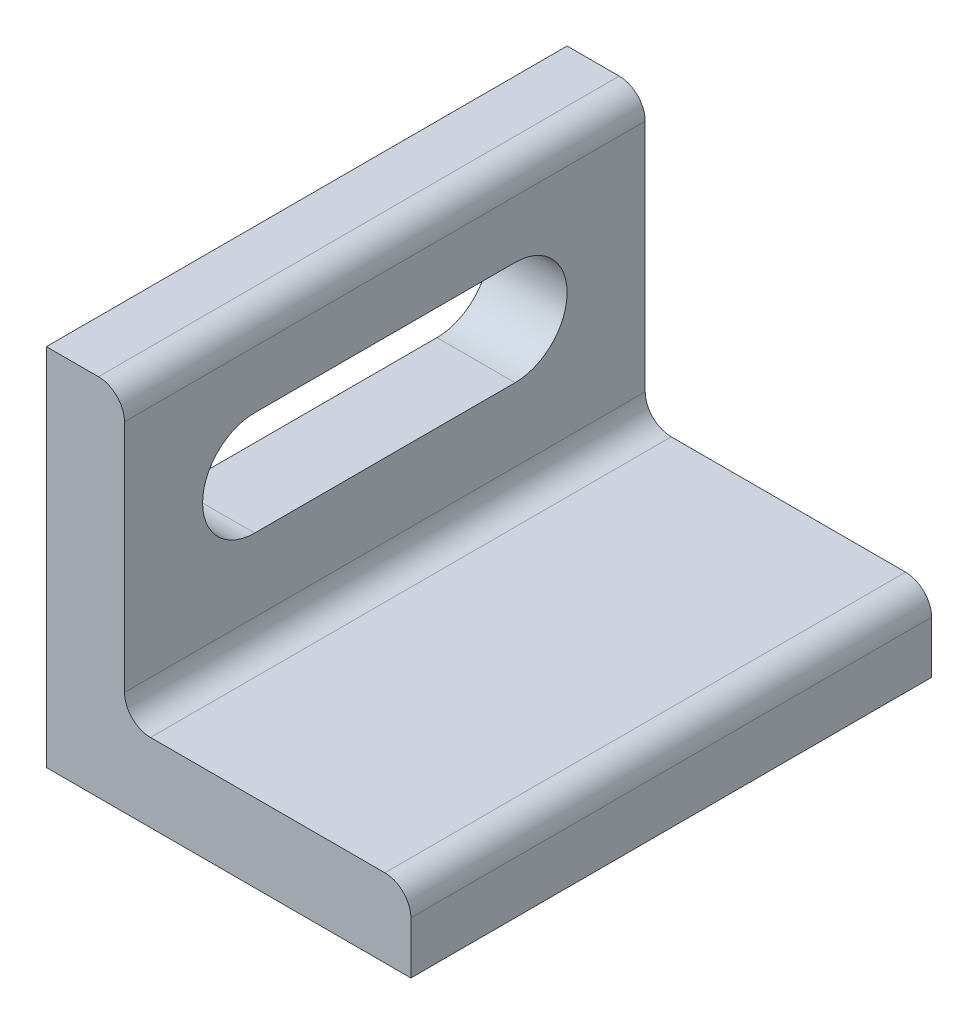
ISO-10303-21;
HEADER;
FILE_DESCRIPTION(('STEP AP214'),'2;1');
FILE_NAME('part.step','',(''),(''),'','','');
FILE_SCHEMA(('AUTOMOTIVE_DESIGN { 1 0 10303 214 1 1 1 1 }'));
ENDSEC;
DATA;
#1=APPLICATION_CONTEXT('core data for automotive mechanical design processes');
#2=APPLICATION_PROTOCOL_DEFINITION('international standard','automotive_design',2000,#1);
#3=PRODUCT_CONTEXT('',#1,'mechanical');
#4=PRODUCT('Part','Part','',(#3));
#5=PRODUCT_RELATED_PRODUCT_CATEGORY('part','',(#4));
#6=PRODUCT_DEFINITION_FORMATION('','',#4);
#7=PRODUCT_DEFINITION_CONTEXT('part definition',#1,'design');
#8=PRODUCT_DEFINITION('design','',#6,#7);
#9=PRODUCT_DEFINITION_SHAPE('','',#8);
#10=(LENGTH_UNIT() NAMED_UNIT(*) SI_UNIT(.MILLI.,.METRE.));
#11=(NAMED_UNIT(*) PLANE_ANGLE_UNIT() SI_UNIT($,.RADIAN.));
#12=(NAMED_UNIT(*) SI_UNIT($,.STERADIAN.) SOLID_ANGLE_UNIT());
#13=UNCERTAINTY_MEASURE_WITH_UNIT(LENGTH_MEASURE(1.E-05),#10,'distance_accuracy_value','');
#14=(GEOMETRIC_REPRESENTATION_CONTEXT(3) GLOBAL_UNCERTAINTY_ASSIGNED_CONTEXT((#13)) GLOBAL_UNIT_ASSIGNED_CONTEXT((#10,
#11,#12)) REPRESENTATION_CONTEXT('',''));
#15=CARTESIAN_POINT('',(0.,0.,0.));
#16=DIRECTION('',(0.,0.,1.));
#17=DIRECTION('',(1.,0.,0.));
#18=AXIS2_PLACEMENT_3D('',#15,#16,#17);
#19=CARTESIAN_POINT('',(70.,15.,100.));
#20=DIRECTION('',(1.,0.,0.));
#21=DIRECTION('',(0.,0.,-1.));
#22=AXIS2_PLACEMENT_3D('',#19,#20,#21);
#23=PLANE('',#22);
#24=DIRECTION('',(0.,-1.,0.));
#25=VECTOR('',#24,1.);
#26=CARTESIAN_POINT('',(70.,15.,0.));
#27=LINE('',#26,#25);
#28=CARTESIAN_POINT('',(70.,10.,0.));
#29=VERTEX_POINT('',#28);
#30=CARTESIAN_POINT('',(70.,0.,0.));
#31=VERTEX_POINT('',#30);
#32=EDGE_CURVE('E175',#29,#31,#27,.T.);
#33=ORIENTED_EDGE('',*,*,#32,.F.);
#34=DIRECTION('',(0.,0.,-1.));
#35=VECTOR('',#34,1.);
#36=CARTESIAN_POINT('',(70.,10.,100.));
#37=LINE('',#36,#35);
#38=CARTESIAN_POINT('',(70.,10.,100.));
#39=VERTEX_POINT('',#38);
#40=EDGE_CURVE('E63',#29,#39,#37,.F.);
#41=ORIENTED_EDGE('',*,*,#40,.T.);
#42=DIRECTION('',(0.,-1.,0.));
#43=VECTOR('',#42,1.);
#44=CARTESIAN_POINT('',(70.,15.,100.));
#45=LINE('',#44,#43);
#46=CARTESIAN_POINT('',(70.,0.,100.));
#47=VERTEX_POINT('',#46);
#48=EDGE_CURVE('E180',#39,#47,#45,.T.);
#49=ORIENTED_EDGE('',*,*,#48,.T.);
#50=DIRECTION('',(0.,0.,-1.));
#51=VECTOR('',#50,1.);
#52=CARTESIAN_POINT('',(70.,0.,100.));
#53=LINE('',#52,#51);
#54=EDGE_CURVE('E203',#47,#31,#53,.T.);
#55=ORIENTED_EDGE('',*,*,#54,.T.);
#56=EDGE_LOOP('',(#33,#41,#49,#55));
#57=FACE_BOUND('',#56,.T.);
#58=ADVANCED_FACE('F39',(#57),#23,.T.);
#59=CARTESIAN_POINT('',(15.,15.,100.));
#60=DIRECTION('',(0.,1.,0.));
#61=DIRECTION('',(0.,0.,1.));
#62=AXIS2_PLACEMENT_3D('',#59,#60,#61);
#63=PLANE('',#62);
#64=DIRECTION('',(1.,0.,0.));
#65=VECTOR('',#64,1.);
#66=CARTESIAN_POINT('',(15.,15.,0.));
#67=LINE('',#66,#65);
#68=CARTESIAN_POINT('',(20.,15.,0.));
#69=VERTEX_POINT('',#68);
#70=CARTESIAN_POINT('',(65.,15.,0.));
#71=VERTEX_POINT('',#70);
#72=EDGE_CURVE('E184',#69,#71,#67,.T.);
#73=ORIENTED_EDGE('',*,*,#72,.F.);
#74=DIRECTION('',(0.,0.,-1.));
#75=VECTOR('',#74,1.);
#76=CARTESIAN_POINT('',(20.,15.,100.));
#77=LINE('',#76,#75);
#78=CARTESIAN_POINT('',(20.,15.,100.));
#79=VERTEX_POINT('',#78);
#80=EDGE_CURVE('E257',#69,#79,#77,.F.);
#81=ORIENTED_EDGE('',*,*,#80,.T.);
#82=DIRECTION('',(1.,0.,0.));
#83=VECTOR('',#82,1.);
#84=CARTESIAN_POINT('',(15.,15.,100.));
#85=LINE('',#84,#83);
#86=CARTESIAN_POINT('',(65.,15.,100.));
#87=VERTEX_POINT('',#86);
#88=EDGE_CURVE('E199',#79,#87,#85,.T.);
#89=ORIENTED_EDGE('',*,*,#88,.T.);
#90=DIRECTION('',(0.,0.,-1.));
#91=VECTOR('',#90,1.);
#92=CARTESIAN_POINT('',(65.,15.,100.));
#93=LINE('',#92,#91);
#94=EDGE_CURVE('E253',#87,#71,#93,.T.);
#95=ORIENTED_EDGE('',*,*,#94,.T.);
#96=EDGE_LOOP('',(#73,#81,#89,#95));
#97=FACE_BOUND('',#96,.T.);
#98=ADVANCED_FACE('F285',(#97),#63,.T.);
#99=CARTESIAN_POINT('',(15.,70.,100.));
#100=DIRECTION('',(1.,0.,0.));
#101=DIRECTION('',(0.,1.,0.));
#102=AXIS2_PLACEMENT_3D('',#99,#100,#101);
#103=PLANE('',#102);
#104=CARTESIAN_POINT('',(15.,44.,75.));
#105=DIRECTION('',(1.,0.,0.));
#106=DIRECTION('',(0.,1.,0.));
#107=AXIS2_PLACEMENT_3D('',#104,#105,#106);
#108=CIRCLE('',#107,10.);
#109=CARTESIAN_POINT('',(15.,54.,75.));
#110=VERTEX_POINT('',#109);
#111=CARTESIAN_POINT('',(15.,34.,75.));
#112=VERTEX_POINT('',#111);
#113=EDGE_CURVE('E160',#110,#112,#108,.T.);
#114=ORIENTED_EDGE('',*,*,#113,.F.);
#115=DIRECTION('',(0.,0.,-1.));
#116=VECTOR('',#115,1.);
#117=CARTESIAN_POINT('',(15.,54.,75.));
#118=LINE('',#117,#116);
#119=CARTESIAN_POINT('',(15.,54.,25.));
#120=VERTEX_POINT('',#119);
#121=EDGE_CURVE('E165',#110,#120,#118,.T.);
#122=ORIENTED_EDGE('',*,*,#121,.T.);
#123=CARTESIAN_POINT('',(15.,44.,25.));
#124=DIRECTION('',(1.,0.,0.));
#125=DIRECTION('',(0.,1.,0.));
#126=AXIS2_PLACEMENT_3D('',#123,#124,#125);
#127=CIRCLE('',#126,10.);
#128=CARTESIAN_POINT('',(15.,34.,25.));
#129=VERTEX_POINT('',#128);
#130=EDGE_CURVE('E142',#129,#120,#127,.T.);
#131=ORIENTED_EDGE('',*,*,#130,.F.);
#132=DIRECTION('',(0.,0.,-1.));
#133=VECTOR('',#132,1.);
#134=CARTESIAN_POINT('',(15.,34.,75.));
#135=LINE('',#134,#133);
#136=EDGE_CURVE('E154',#112,#129,#135,.T.);
#137=ORIENTED_EDGE('',*,*,#136,.F.);
#138=EDGE_LOOP('',(#114,#122,#131,#137));
#139=FACE_BOUND('',#138,.T.);
#140=DIRECTION('',(0.,-1.,0.));
#141=VECTOR('',#140,1.);
#142=CARTESIAN_POINT('',(15.,70.,100.));
#143=LINE('',#142,#141);
#144=CARTESIAN_POINT('',(15.,65.,100.));
#145=VERTEX_POINT('',#144);
#146=CARTESIAN_POINT('',(15.,20.,100.));
#147=VERTEX_POINT('',#146);
#148=EDGE_CURVE('E195',#145,#147,#143,.T.);
#149=ORIENTED_EDGE('',*,*,#148,.T.);
#150=DIRECTION('',(0.,0.,-1.));
#151=VECTOR('',#150,1.);
#152=CARTESIAN_POINT('',(15.,20.,0.));
#153=LINE('',#152,#151);
#154=CARTESIAN_POINT('',(15.,20.,0.));
#155=VERTEX_POINT('',#154);
#156=EDGE_CURVE('E249',#147,#155,#153,.T.);
#157=ORIENTED_EDGE('',*,*,#156,.T.);
#158=DIRECTION('',(0.,-1.,0.));
#159=VECTOR('',#158,1.);
#160=CARTESIAN_POINT('',(15.,70.,0.));
#161=LINE('',#160,#159);
#162=CARTESIAN_POINT('',(15.,65.,0.));
#163=VERTEX_POINT('',#162);
#164=EDGE_CURVE('E218',#163,#155,#161,.T.);
#165=ORIENTED_EDGE('',*,*,#164,.F.);
#166=DIRECTION('',(0.,0.,-1.));
#167=VECTOR('',#166,1.);
#168=CARTESIAN_POINT('',(15.,65.,100.));
#169=LINE('',#168,#167);
#170=EDGE_CURVE('E246',#163,#145,#169,.F.);
#171=ORIENTED_EDGE('',*,*,#170,.T.);
#172=EDGE_LOOP('',(#149,#157,#165,#171));
#173=FACE_BOUND('',#172,.T.);
#174=ADVANCED_FACE('F162',(#139,#173),#103,.T.);
#175=CARTESIAN_POINT('',(0.,70.,100.));
#176=DIRECTION('',(0.,1.,0.));
#177=DIRECTION('',(0.,0.,1.));
#178=AXIS2_PLACEMENT_3D('',#175,#176,#177);
#179=PLANE('',#178);
#180=DIRECTION('',(1.,0.,0.));
#181=VECTOR('',#180,1.);
#182=CARTESIAN_POINT('',(0.,70.,100.));
#183=LINE('',#182,#181);
#184=CARTESIAN_POINT('',(0.,70.,100.));
#185=VERTEX_POINT('',#184);
#186=CARTESIAN_POINT('',(10.,70.,100.));
#187=VERTEX_POINT('',#186);
#188=EDGE_CURVE('E192',#185,#187,#183,.T.);
#189=ORIENTED_EDGE('',*,*,#188,.T.);
#190=DIRECTION('',(0.,0.,-1.));
#191=VECTOR('',#190,1.);
#192=CARTESIAN_POINT('',(10.,70.,100.));
#193=LINE('',#192,#191);
#194=CARTESIAN_POINT('',(10.,70.,0.));
#195=VERTEX_POINT('',#194);
#196=EDGE_CURVE('E273',#187,#195,#193,.T.);
#197=ORIENTED_EDGE('',*,*,#196,.T.);
#198=DIRECTION('',(1.,0.,0.));
#199=VECTOR('',#198,1.);
#200=CARTESIAN_POINT('',(0.,70.,0.));
#201=LINE('',#200,#199);
#202=CARTESIAN_POINT('',(0.,70.,0.));
#203=VERTEX_POINT('',#202);
#204=EDGE_CURVE('E214',#203,#195,#201,.T.);
#205=ORIENTED_EDGE('',*,*,#204,.F.);
#206=DIRECTION('',(0.,0.,-1.));
#207=VECTOR('',#206,1.);
#208=CARTESIAN_POINT('',(0.,70.,100.));
#209=LINE('',#208,#207);
#210=EDGE_CURVE('E225',#185,#203,#209,.T.);
#211=ORIENTED_EDGE('',*,*,#210,.F.);
#212=EDGE_LOOP('',(#189,#197,#205,#211));
#213=FACE_BOUND('',#212,.T.);
#214=ADVANCED_FACE('F296',(#213),#179,.T.);
#215=CARTESIAN_POINT('',(0.,0.,100.));
#216=DIRECTION('',(-1.,0.,0.));
#217=DIRECTION('',(0.,0.,1.));
#218=AXIS2_PLACEMENT_3D('',#215,#216,#217);
#219=PLANE('',#218);
#220=CARTESIAN_POINT('',(0.,44.,75.));
#221=DIRECTION('',(-1.,0.,0.));
#222=DIRECTION('',(0.,0.,1.));
#223=AXIS2_PLACEMENT_3D('',#220,#221,#222);
#224=CIRCLE('',#223,10.);
#225=CARTESIAN_POINT('',(0.,34.,75.));
#226=VERTEX_POINT('',#225);
#227=CARTESIAN_POINT('',(0.,54.,75.));
#228=VERTEX_POINT('',#227);
#229=EDGE_CURVE('E243',#226,#228,#224,.T.);
#230=ORIENTED_EDGE('',*,*,#229,.F.);
#231=DIRECTION('',(0.,0.,1.));
#232=VECTOR('',#231,1.);
#233=CARTESIAN_POINT('',(0.,34.,100.));
#234=LINE('',#233,#232);
#235=CARTESIAN_POINT('',(0.,34.,25.));
#236=VERTEX_POINT('',#235);
#237=EDGE_CURVE('E228',#236,#226,#234,.T.);
#238=ORIENTED_EDGE('',*,*,#237,.F.);
#239=CARTESIAN_POINT('',(0.,44.,25.));
#240=DIRECTION('',(-1.,0.,0.));
#241=DIRECTION('',(0.,0.,1.));
#242=AXIS2_PLACEMENT_3D('',#239,#240,#241);
#243=CIRCLE('',#242,10.);
#244=CARTESIAN_POINT('',(0.,54.,25.));
#245=VERTEX_POINT('',#244);
#246=EDGE_CURVE('E145',#245,#236,#243,.T.);
#247=ORIENTED_EDGE('',*,*,#246,.F.);
#248=DIRECTION('',(0.,0.,1.));
#249=VECTOR('',#248,1.);
#250=CARTESIAN_POINT('',(0.,54.,100.));
#251=LINE('',#250,#249);
#252=EDGE_CURVE('E239',#245,#228,#251,.T.);
#253=ORIENTED_EDGE('',*,*,#252,.T.);
#254=EDGE_LOOP('',(#230,#238,#247,#253));
#255=FACE_BOUND('',#254,.T.);
#256=DIRECTION('',(0.,1.,0.));
#257=VECTOR('',#256,1.);
#258=CARTESIAN_POINT('',(0.,0.,0.));
#259=LINE('',#258,#257);
#260=CARTESIAN_POINT('',(0.,0.,0.));
#261=VERTEX_POINT('',#260);
#262=EDGE_CURVE('E210',#261,#203,#259,.T.);
#263=ORIENTED_EDGE('',*,*,#262,.F.);
#264=DIRECTION('',(0.,0.,-1.));
#265=VECTOR('',#264,1.);
#266=CARTESIAN_POINT('',(0.,0.,100.));
#267=LINE('',#266,#265);
#268=CARTESIAN_POINT('',(0.,0.,100.));
#269=VERTEX_POINT('',#268);
#270=EDGE_CURVE('E229',#269,#261,#267,.T.);
#271=ORIENTED_EDGE('',*,*,#270,.F.);
#272=DIRECTION('',(0.,1.,0.));
#273=VECTOR('',#272,1.);
#274=CARTESIAN_POINT('',(0.,0.,100.));
#275=LINE('',#274,#273);
#276=EDGE_CURVE('E188',#269,#185,#275,.T.);
#277=ORIENTED_EDGE('',*,*,#276,.T.);
#278=ORIENTED_EDGE('',*,*,#210,.T.);
#279=EDGE_LOOP('',(#263,#271,#277,#278));
#280=FACE_BOUND('',#279,.T.);
#281=ADVANCED_FACE('F300',(#255,#280),#219,.T.);
#282=CARTESIAN_POINT('',(0.,0.,100.));
#283=DIRECTION('',(0.,1.,0.));
#284=DIRECTION('',(0.,0.,1.));
#285=AXIS2_PLACEMENT_3D('',#282,#283,#284);
#286=PLANE('',#285);
#287=DIRECTION('',(1.,0.,0.));
#288=VECTOR('',#287,1.);
#289=CARTESIAN_POINT('',(0.,0.,0.));
#290=LINE('',#289,#288);
#291=EDGE_CURVE('E206',#261,#31,#290,.T.);
#292=ORIENTED_EDGE('',*,*,#291,.T.);
#293=ORIENTED_EDGE('',*,*,#54,.F.);
#294=DIRECTION('',(1.,0.,0.));
#295=VECTOR('',#294,1.);
#296=CARTESIAN_POINT('',(0.,0.,100.));
#297=LINE('',#296,#295);
#298=EDGE_CURVE('E183',#269,#47,#297,.T.);
#299=ORIENTED_EDGE('',*,*,#298,.F.);
#300=ORIENTED_EDGE('',*,*,#270,.T.);
#301=EDGE_LOOP('',(#292,#293,#299,#300));
#302=FACE_BOUND('',#301,.T.);
#303=ADVANCED_FACE('F306',(#302),#286,.F.);
#304=CARTESIAN_POINT('',(0.,0.,100.));
#305=DIRECTION('',(0.,0.,1.));
#306=DIRECTION('',(1.,0.,0.));
#307=AXIS2_PLACEMENT_3D('',#304,#305,#306);
#308=PLANE('',#307);
#309=ORIENTED_EDGE('',*,*,#48,.F.);
#310=CARTESIAN_POINT('',(65.,10.,100.));
#311=DIRECTION('',(0.,0.,1.));
#312=DIRECTION('',(1.,0.,0.));
#313=AXIS2_PLACEMENT_3D('',#310,#311,#312);
#314=CIRCLE('',#313,5.);
#315=EDGE_CURVE('E270',#39,#87,#314,.T.);
#316=ORIENTED_EDGE('',*,*,#315,.T.);
#317=ORIENTED_EDGE('',*,*,#88,.F.);
#318=CARTESIAN_POINT('',(20.,20.,100.));
#319=DIRECTION('',(0.,0.,1.));
#320=DIRECTION('',(1.,0.,0.));
#321=AXIS2_PLACEMENT_3D('',#318,#319,#320);
#322=CIRCLE('',#321,5.);
#323=EDGE_CURVE('E11',#79,#147,#322,.F.);
#324=ORIENTED_EDGE('',*,*,#323,.T.);
#325=ORIENTED_EDGE('',*,*,#148,.F.);
#326=CARTESIAN_POINT('',(10.,65.,100.));
#327=DIRECTION('',(0.,0.,1.));
#328=DIRECTION('',(1.,0.,0.));
#329=AXIS2_PLACEMENT_3D('',#326,#327,#328);
#330=CIRCLE('',#329,5.);
#331=EDGE_CURVE('E55',#145,#187,#330,.T.);
#332=ORIENTED_EDGE('',*,*,#331,.T.);
#333=ORIENTED_EDGE('',*,*,#188,.F.);
#334=ORIENTED_EDGE('',*,*,#276,.F.);
#335=ORIENTED_EDGE('',*,*,#298,.T.);
#336=EDGE_LOOP('',(#309,#316,#317,#324,#325,#332,#333,#334,#335));
#337=FACE_BOUND('',#336,.T.);
#338=ADVANCED_FACE('F290',(#337),#308,.T.);
#339=CARTESIAN_POINT('',(0.,0.,0.));
#340=DIRECTION('',(0.,0.,1.));
#341=DIRECTION('',(1.,0.,0.));
#342=AXIS2_PLACEMENT_3D('',#339,#340,#341);
#343=PLANE('',#342);
#344=ORIENTED_EDGE('',*,*,#72,.T.);
#345=CARTESIAN_POINT('',(65.,10.,0.));
#346=DIRECTION('',(0.,0.,1.));
#347=DIRECTION('',(1.,0.,0.));
#348=AXIS2_PLACEMENT_3D('',#345,#346,#347);
#349=CIRCLE('',#348,5.);
#350=EDGE_CURVE('E263',#71,#29,#349,.F.);
#351=ORIENTED_EDGE('',*,*,#350,.T.);
#352=ORIENTED_EDGE('',*,*,#32,.T.);
#353=ORIENTED_EDGE('',*,*,#291,.F.);
#354=ORIENTED_EDGE('',*,*,#262,.T.);
#355=ORIENTED_EDGE('',*,*,#204,.T.);
#356=CARTESIAN_POINT('',(10.,65.,0.));
#357=DIRECTION('',(0.,0.,1.));
#358=DIRECTION('',(1.,0.,0.));
#359=AXIS2_PLACEMENT_3D('',#356,#357,#358);
#360=CIRCLE('',#359,5.);
#361=EDGE_CURVE('E260',#195,#163,#360,.F.);
#362=ORIENTED_EDGE('',*,*,#361,.T.);
#363=ORIENTED_EDGE('',*,*,#164,.T.);
#364=CARTESIAN_POINT('',(20.,20.,0.));
#365=DIRECTION('',(0.,0.,1.));
#366=DIRECTION('',(1.,0.,0.));
#367=AXIS2_PLACEMENT_3D('',#364,#365,#366);
#368=CIRCLE('',#367,5.);
#369=EDGE_CURVE('E48',#155,#69,#368,.T.);
#370=ORIENTED_EDGE('',*,*,#369,.T.);
#371=EDGE_LOOP('',(#344,#351,#352,#353,#354,#355,#362,#363,#370));
#372=FACE_BOUND('',#371,.T.);
#373=ADVANCED_FACE('F279',(#372),#343,.F.);
#374=CARTESIAN_POINT('',(-4.99999999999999,44.,75.));
#375=DIRECTION('',(1.,0.,0.));
#376=DIRECTION('',(0.,1.,0.));
#377=AXIS2_PLACEMENT_3D('',#374,#375,#376);
#378=CYLINDRICAL_SURFACE('',#377,10.);
#379=ORIENTED_EDGE('',*,*,#229,.T.);
#380=DIRECTION('',(1.,0.,0.));
#381=VECTOR('',#380,1.);
#382=CARTESIAN_POINT('',(-4.99999999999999,54.,75.));
#383=LINE('',#382,#381);
#384=EDGE_CURVE('E172',#228,#110,#383,.T.);
#385=ORIENTED_EDGE('',*,*,#384,.T.);
#386=ORIENTED_EDGE('',*,*,#113,.T.);
#387=DIRECTION('',(1.,0.,0.));
#388=VECTOR('',#387,1.);
#389=CARTESIAN_POINT('',(-4.99999999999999,34.,75.));
#390=LINE('',#389,#388);
#391=EDGE_CURVE('E150',#226,#112,#390,.T.);
#392=ORIENTED_EDGE('',*,*,#391,.F.);
#393=EDGE_LOOP('',(#379,#385,#386,#392));
#394=FACE_BOUND('',#393,.T.);
#395=ADVANCED_FACE('F333',(#394),#378,.F.);
#396=CARTESIAN_POINT('',(-4.99999999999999,54.,75.));
#397=DIRECTION('',(0.,-1.,0.));
#398=DIRECTION('',(1.,0.,0.));
#399=AXIS2_PLACEMENT_3D('',#396,#397,#398);
#400=PLANE('',#399);
#401=DIRECTION('',(1.,0.,0.));
#402=VECTOR('',#401,1.);
#403=CARTESIAN_POINT('',(-4.99999999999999,54.,25.));
#404=LINE('',#403,#402);
#405=EDGE_CURVE('E149',#245,#120,#404,.T.);
#406=ORIENTED_EDGE('',*,*,#405,.T.);
#407=ORIENTED_EDGE('',*,*,#121,.F.);
#408=ORIENTED_EDGE('',*,*,#384,.F.);
#409=ORIENTED_EDGE('',*,*,#252,.F.);
#410=EDGE_LOOP('',(#406,#407,#408,#409));
#411=FACE_BOUND('',#410,.T.);
#412=ADVANCED_FACE('F338',(#411),#400,.T.);
#413=CARTESIAN_POINT('',(-4.99999999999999,44.,25.));
#414=DIRECTION('',(1.,0.,0.));
#415=DIRECTION('',(0.,1.,0.));
#416=AXIS2_PLACEMENT_3D('',#413,#414,#415);
#417=CYLINDRICAL_SURFACE('',#416,10.);
#418=ORIENTED_EDGE('',*,*,#246,.T.);
#419=DIRECTION('',(1.,0.,0.));
#420=VECTOR('',#419,1.);
#421=CARTESIAN_POINT('',(-4.99999999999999,34.,25.));
#422=LINE('',#421,#420);
#423=EDGE_CURVE('E137',#236,#129,#422,.T.);
#424=ORIENTED_EDGE('',*,*,#423,.T.);
#425=ORIENTED_EDGE('',*,*,#130,.T.);
#426=ORIENTED_EDGE('',*,*,#405,.F.);
#427=EDGE_LOOP('',(#418,#424,#425,#426));
#428=FACE_BOUND('',#427,.T.);
#429=ADVANCED_FACE('F139',(#428),#417,.F.);
#430=CARTESIAN_POINT('',(-4.99999999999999,34.,75.));
#431=DIRECTION('',(0.,-1.,0.));
#432=DIRECTION('',(1.,0.,0.));
#433=AXIS2_PLACEMENT_3D('',#430,#431,#432);
#434=PLANE('',#433);
#435=ORIENTED_EDGE('',*,*,#237,.T.);
#436=ORIENTED_EDGE('',*,*,#391,.T.);
#437=ORIENTED_EDGE('',*,*,#136,.T.);
#438=ORIENTED_EDGE('',*,*,#423,.F.);
#439=EDGE_LOOP('',(#435,#436,#437,#438));
#440=FACE_BOUND('',#439,.T.);
#441=ADVANCED_FACE('F155',(#440),#434,.F.);
#442=CARTESIAN_POINT('',(20.,20.,100.));
#443=DIRECTION('',(0.,0.,1.));
#444=DIRECTION('',(1.,0.,0.));
#445=AXIS2_PLACEMENT_3D('',#442,#443,#444);
#446=CYLINDRICAL_SURFACE('',#445,5.);
#447=ORIENTED_EDGE('',*,*,#323,.F.);
#448=ORIENTED_EDGE('',*,*,#80,.F.);
#449=ORIENTED_EDGE('',*,*,#369,.F.);
#450=ORIENTED_EDGE('',*,*,#156,.F.);
#451=EDGE_LOOP('',(#447,#448,#449,#450));
#452=FACE_BOUND('',#451,.T.);
#453=ADVANCED_FACE('F289',(#452),#446,.F.);
#454=CARTESIAN_POINT('',(65.,10.,100.));
#455=DIRECTION('',(0.,0.,-1.));
#456=DIRECTION('',(-1.,0.,0.));
#457=AXIS2_PLACEMENT_3D('',#454,#455,#456);
#458=CYLINDRICAL_SURFACE('',#457,5.);
#459=ORIENTED_EDGE('',*,*,#315,.F.);
#460=ORIENTED_EDGE('',*,*,#40,.F.);
#461=ORIENTED_EDGE('',*,*,#350,.F.);
#462=ORIENTED_EDGE('',*,*,#94,.F.);
#463=EDGE_LOOP('',(#459,#460,#461,#462));
#464=FACE_BOUND('',#463,.T.);
#465=ADVANCED_FACE('F308',(#464),#458,.T.);
#466=CARTESIAN_POINT('',(10.,65.,100.));
#467=DIRECTION('',(0.,0.,-1.));
#468=DIRECTION('',(-1.,0.,0.));
#469=AXIS2_PLACEMENT_3D('',#466,#467,#468);
#470=CYLINDRICAL_SURFACE('',#469,5.);
#471=ORIENTED_EDGE('',*,*,#331,.F.);
#472=ORIENTED_EDGE('',*,*,#170,.F.);
#473=ORIENTED_EDGE('',*,*,#361,.F.);
#474=ORIENTED_EDGE('',*,*,#196,.F.);
#475=EDGE_LOOP('',(#471,#472,#473,#474));
#476=FACE_BOUND('',#475,.T.);
#477=ADVANCED_FACE('F41',(#476),#470,.T.);
#478=CLOSED_SHELL('',(#58,#98,#174,#214,#281,#303,#338,#373,#395,#412,#429,#441,#453,#465,#477));
#479=MANIFOLD_SOLID_BREP('B2',#478);
#480=ADVANCED_BREP_SHAPE_REPRESENTATION('',(#18,#479),#14);
#481=SHAPE_DEFINITION_REPRESENTATION(#9,#480);
ENDSEC;
END-ISO-10303-21;
